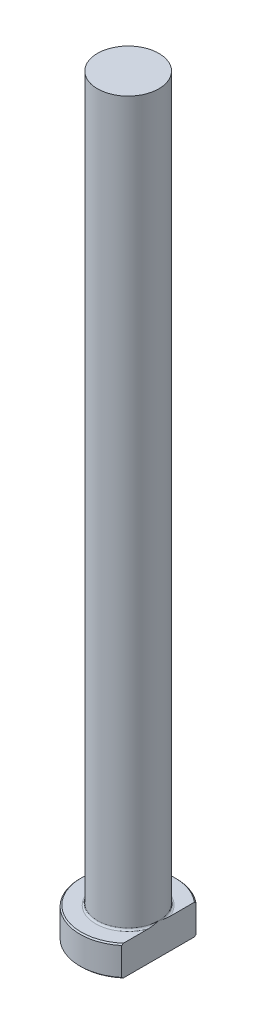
ISO-10303-21;
HEADER;
FILE_DESCRIPTION(('STEP AP214'),'2;1');
FILE_NAME('part.step','',(''),(''),'','','');
FILE_SCHEMA(('AUTOMOTIVE_DESIGN { 1 0 10303 214 1 1 1 1 }'));
ENDSEC;
DATA;
#1=APPLICATION_CONTEXT('core data for automotive mechanical design processes');
#2=APPLICATION_PROTOCOL_DEFINITION('international standard','automotive_design',2000,#1);
#3=PRODUCT_CONTEXT('',#1,'mechanical');
#4=PRODUCT('Part','Part','',(#3));
#5=PRODUCT_RELATED_PRODUCT_CATEGORY('part','',(#4));
#6=PRODUCT_DEFINITION_FORMATION('','',#4);
#7=PRODUCT_DEFINITION_CONTEXT('part definition',#1,'design');
#8=PRODUCT_DEFINITION('design','',#6,#7);
#9=PRODUCT_DEFINITION_SHAPE('','',#8);
#10=(LENGTH_UNIT() NAMED_UNIT(*) SI_UNIT(.MILLI.,.METRE.));
#11=(NAMED_UNIT(*) PLANE_ANGLE_UNIT() SI_UNIT($,.RADIAN.));
#12=(NAMED_UNIT(*) SI_UNIT($,.STERADIAN.) SOLID_ANGLE_UNIT());
#13=UNCERTAINTY_MEASURE_WITH_UNIT(LENGTH_MEASURE(1.E-05),#10,'distance_accuracy_value','');
#14=(GEOMETRIC_REPRESENTATION_CONTEXT(3) GLOBAL_UNCERTAINTY_ASSIGNED_CONTEXT((#13)) GLOBAL_UNIT_ASSIGNED_CONTEXT((#10,
#11,#12)) REPRESENTATION_CONTEXT('',''));
#15=CARTESIAN_POINT('',(0.,0.,0.));
#16=DIRECTION('',(0.,0.,1.));
#17=DIRECTION('',(1.,0.,0.));
#18=AXIS2_PLACEMENT_3D('',#15,#16,#17);
#19=CARTESIAN_POINT('',(0.,0.,0.));
#20=DIRECTION('',(0.,-1.,0.));
#21=DIRECTION('',(0.,0.,-1.));
#22=AXIS2_PLACEMENT_3D('',#19,#20,#21);
#23=PLANE('',#22);
#24=CARTESIAN_POINT('',(0.,0.,0.));
#25=DIRECTION('',(0.,-1.,0.));
#26=DIRECTION('',(0.,0.,-1.));
#27=AXIS2_PLACEMENT_3D('',#24,#25,#26);
#28=CIRCLE('',#27,7.80000000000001);
#29=CARTESIAN_POINT('',(5.09999999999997,0.,5.90169467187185));
#30=VERTEX_POINT('',#29);
#31=CARTESIAN_POINT('',(5.09999999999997,0.,-5.90169467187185));
#32=VERTEX_POINT('',#31);
#33=EDGE_CURVE('E98',#30,#32,#28,.T.);
#34=ORIENTED_EDGE('',*,*,#33,.T.);
#35=DIRECTION('',(0.,0.,1.));
#36=VECTOR('',#35,1.);
#37=CARTESIAN_POINT('',(5.09999999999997,0.,-6.16360284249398));
#38=LINE('',#37,#36);
#39=EDGE_CURVE('E83',#32,#30,#38,.T.);
#40=ORIENTED_EDGE('',*,*,#39,.T.);
#41=EDGE_LOOP('',(#34,#40));
#42=FACE_BOUND('',#41,.T.);
#43=ADVANCED_FACE('F32',(#42),#23,.T.);
#44=CARTESIAN_POINT('',(0.,259.958771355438,0.));
#45=DIRECTION('',(0.,1.,0.));
#46=DIRECTION('',(0.,0.,1.));
#47=AXIS2_PLACEMENT_3D('',#44,#45,#46);
#48=CYLINDRICAL_SURFACE('',#47,7.99999999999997);
#49=CARTESIAN_POINT('',(0.,4.79999999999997,0.));
#50=DIRECTION('',(0.,1.,0.));
#51=DIRECTION('',(0.,0.,1.));
#52=AXIS2_PLACEMENT_3D('',#49,#50,#51);
#53=CIRCLE('',#52,7.99999999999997);
#54=CARTESIAN_POINT('',(5.09999999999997,4.79999999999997,6.16360284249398));
#55=VERTEX_POINT('',#54);
#56=CARTESIAN_POINT('',(5.09999999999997,4.79999999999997,-6.16360284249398));
#57=VERTEX_POINT('',#56);
#58=EDGE_CURVE('E104',#55,#57,#53,.F.);
#59=ORIENTED_EDGE('',*,*,#58,.T.);
#60=DIRECTION('',(0.,-1.,0.));
#61=VECTOR('',#60,1.);
#62=CARTESIAN_POINT('',(5.09999999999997,125.,-6.16360284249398));
#63=LINE('',#62,#61);
#64=CARTESIAN_POINT('',(5.09999999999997,0.199999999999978,-6.16360284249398));
#65=VERTEX_POINT('',#64);
#66=EDGE_CURVE('E183',#57,#65,#63,.T.);
#67=ORIENTED_EDGE('',*,*,#66,.T.);
#68=CARTESIAN_POINT('',(0.,0.199999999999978,0.));
#69=DIRECTION('',(0.,-1.,0.));
#70=DIRECTION('',(0.,0.,-1.));
#71=AXIS2_PLACEMENT_3D('',#68,#69,#70);
#72=CIRCLE('',#71,7.99999999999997);
#73=CARTESIAN_POINT('',(5.09999999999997,0.199999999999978,6.16360284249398));
#74=VERTEX_POINT('',#73);
#75=EDGE_CURVE('E100',#65,#74,#72,.F.);
#76=ORIENTED_EDGE('',*,*,#75,.T.);
#77=DIRECTION('',(0.,-1.,0.));
#78=VECTOR('',#77,1.);
#79=CARTESIAN_POINT('',(5.09999999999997,125.,6.16360284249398));
#80=LINE('',#79,#78);
#81=EDGE_CURVE('E93',#55,#74,#80,.T.);
#82=ORIENTED_EDGE('',*,*,#81,.F.);
#83=EDGE_LOOP('',(#59,#67,#76,#82));
#84=FACE_BOUND('',#83,.T.);
#85=ADVANCED_FACE('F158',(#84),#48,.T.);
#86=CARTESIAN_POINT('',(-7.99999999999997,5.,0.));
#87=DIRECTION('',(0.,1.,0.));
#88=DIRECTION('',(0.,0.,1.));
#89=AXIS2_PLACEMENT_3D('',#86,#87,#88);
#90=PLANE('',#89);
#91=CARTESIAN_POINT('',(0.,5.,0.));
#92=DIRECTION('',(0.,1.,0.));
#93=DIRECTION('',(0.,0.,1.));
#94=AXIS2_PLACEMENT_3D('',#91,#92,#93);
#95=CIRCLE('',#94,7.79999999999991);
#96=CARTESIAN_POINT('',(5.09999999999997,5.,-5.90169467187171));
#97=VERTEX_POINT('',#96);
#98=CARTESIAN_POINT('',(5.09999999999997,5.,5.90169467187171));
#99=VERTEX_POINT('',#98);
#100=EDGE_CURVE('E178',#97,#99,#95,.T.);
#101=ORIENTED_EDGE('',*,*,#100,.T.);
#102=DIRECTION('',(0.,0.,-1.));
#103=VECTOR('',#102,1.);
#104=CARTESIAN_POINT('',(5.09999999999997,5.,0.));
#105=LINE('',#104,#103);
#106=CARTESIAN_POINT('',(5.09999999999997,4.99999999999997,1.77482393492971));
#107=VERTEX_POINT('',#106);
#108=EDGE_CURVE('E57',#99,#107,#105,.T.);
#109=ORIENTED_EDGE('',*,*,#108,.T.);
#110=CARTESIAN_POINT('',(0.,5.,0.));
#111=DIRECTION('',(0.,1.,0.));
#112=DIRECTION('',(0.,0.,1.));
#113=AXIS2_PLACEMENT_3D('',#110,#111,#112);
#114=CIRCLE('',#113,5.39999999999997);
#115=CARTESIAN_POINT('',(5.09999999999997,4.99999999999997,-1.77482393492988));
#116=VERTEX_POINT('',#115);
#117=EDGE_CURVE('E107',#107,#116,#114,.F.);
#118=ORIENTED_EDGE('',*,*,#117,.T.);
#119=EDGE_CURVE('E136',#116,#97,#105,.T.);
#120=ORIENTED_EDGE('',*,*,#119,.T.);
#121=EDGE_LOOP('',(#101,#109,#118,#120));
#122=FACE_BOUND('',#121,.T.);
#123=ADVANCED_FACE('F147',(#122),#90,.T.);
#124=CARTESIAN_POINT('',(0.,5.,0.));
#125=DIRECTION('',(0.,-1.,0.));
#126=DIRECTION('',(0.,0.,-1.));
#127=AXIS2_PLACEMENT_3D('',#124,#125,#126);
#128=CONICAL_SURFACE('',#127,7.7999999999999,0.785398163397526);
#129=ORIENTED_EDGE('',*,*,#58,.F.);
#130=CARTESIAN_POINT('',(5.09999999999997,-1.68838926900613,13.5610996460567));
#131=CARTESIAN_POINT('',(5.09999999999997,-1.4911744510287,13.3503958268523));
#132=CARTESIAN_POINT('',(5.09999999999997,-1.29425912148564,13.1394117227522));
#133=CARTESIAN_POINT('',(5.09999999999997,-0.90112453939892,12.716793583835));
#134=CARTESIAN_POINT('',(5.09999999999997,-0.704905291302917,12.5051595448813));
#135=CARTESIAN_POINT('',(5.09999999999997,-0.117342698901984,11.8690459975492));
#136=CARTESIAN_POINT('',(5.09999999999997,0.272806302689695,11.4434608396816));
#137=CARTESIAN_POINT('',(5.09999999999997,1.05193640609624,10.5848872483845));
#138=CARTESIAN_POINT('',(5.09999999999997,1.44088225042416,10.1518667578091));
#139=CARTESIAN_POINT('',(5.09999999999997,2.21252525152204,9.28039822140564));
#140=CARTESIAN_POINT('',(5.09999999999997,2.5952233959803,8.84195105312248));
#141=CARTESIAN_POINT('',(5.09999999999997,3.28346545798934,8.03678680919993));
#142=CARTESIAN_POINT('',(5.09999999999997,3.59050446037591,7.67135442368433));
#143=CARTESIAN_POINT('',(5.09999999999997,4.04444149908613,7.11764573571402));
#144=CARTESIAN_POINT('',(5.09999999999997,4.19468098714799,6.93211011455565));
#145=CARTESIAN_POINT('',(5.09999999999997,4.49242146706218,6.55885365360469));
#146=CARTESIAN_POINT('',(5.09999999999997,4.63992249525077,6.37113284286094));
#147=CARTESIAN_POINT('',(5.09999999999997,4.93124846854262,5.99346825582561));
#148=CARTESIAN_POINT('',(5.09999999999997,5.07508033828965,5.80352983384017));
#149=CARTESIAN_POINT('',(5.09999999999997,5.35853965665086,5.42051054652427));
#150=CARTESIAN_POINT('',(5.09999999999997,5.49816682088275,5.22742946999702));
#151=CARTESIAN_POINT('',(5.09999999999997,5.77196390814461,4.83761664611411));
#152=CARTESIAN_POINT('',(5.09999999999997,5.9061374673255,4.64088746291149));
#153=CARTESIAN_POINT('',(5.09999999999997,6.16753864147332,4.24288639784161));
#154=CARTESIAN_POINT('',(5.09999999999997,6.2947675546,4.04161537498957));
#155=CARTESIAN_POINT('',(5.09999999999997,6.51869473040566,3.66918005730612));
#156=CARTESIAN_POINT('',(5.09999999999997,6.61684568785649,3.49889306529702));
#157=CARTESIAN_POINT('',(5.09999999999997,6.80528626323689,3.15396122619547));
#158=CARTESIAN_POINT('',(5.09999999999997,6.8955749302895,2.97931585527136));
#159=CARTESIAN_POINT('',(5.09999999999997,7.06604933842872,2.6253063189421));
#160=CARTESIAN_POINT('',(5.09999999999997,7.14624387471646,2.44594642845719));
#161=CARTESIAN_POINT('',(5.09999999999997,7.29389284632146,2.08202755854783));
#162=CARTESIAN_POINT('',(5.09999999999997,7.36135077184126,1.89747001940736));
#163=CARTESIAN_POINT('',(5.09999999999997,7.4678794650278,1.56242413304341));
#164=CARTESIAN_POINT('',(5.09999999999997,7.50993657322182,1.41289089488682));
#165=CARTESIAN_POINT('',(5.09999999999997,7.58244227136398,1.11101527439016));
#166=CARTESIAN_POINT('',(5.09999999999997,7.61289239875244,0.95867326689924));
#167=CARTESIAN_POINT('',(5.09999999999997,7.66066060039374,0.652384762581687));
#168=CARTESIAN_POINT('',(5.09999999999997,7.67801796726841,0.498444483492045));
#169=CARTESIAN_POINT('',(5.09999999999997,7.69880109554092,0.189616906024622));
#170=CARTESIAN_POINT('',(5.09999999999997,7.70222744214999,0.0347296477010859));
#171=CARTESIAN_POINT('',(5.09999999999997,7.69494415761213,-0.274953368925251));
#172=CARTESIAN_POINT('',(5.09999999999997,7.68421202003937,-0.429748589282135));
#173=CARTESIAN_POINT('',(5.09999999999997,7.64918519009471,-0.737784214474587));
#174=CARTESIAN_POINT('',(5.09999999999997,7.62488939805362,-0.891024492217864));
#175=CARTESIAN_POINT('',(5.09999999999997,7.56389278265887,-1.19546940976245));
#176=CARTESIAN_POINT('',(5.09999999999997,7.52715417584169,-1.34666637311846));
#177=CARTESIAN_POINT('',(5.09999999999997,7.44288917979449,-1.64598767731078));
#178=CARTESIAN_POINT('',(5.09999999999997,7.39536249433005,-1.79411193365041));
#179=CARTESIAN_POINT('',(5.09999999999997,7.28286361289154,-2.11045286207));
#180=CARTESIAN_POINT('',(5.09999999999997,7.21631794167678,-2.27810587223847));
#181=CARTESIAN_POINT('',(5.09999999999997,7.07327742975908,-2.60914825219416));
#182=CARTESIAN_POINT('',(5.09999999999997,6.99677812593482,-2.77253566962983));
#183=CARTESIAN_POINT('',(5.09999999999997,6.83568399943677,-3.09559415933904));
#184=CARTESIAN_POINT('',(5.09999999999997,6.75107532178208,-3.25525827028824));
#185=CARTESIAN_POINT('',(5.09999999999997,6.57547395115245,-3.57098467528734));
#186=CARTESIAN_POINT('',(5.09999999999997,6.48448213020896,-3.72704745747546));
#187=CARTESIAN_POINT('',(5.09999999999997,6.29613682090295,-4.03803676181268));
#188=CARTESIAN_POINT('',(5.09999999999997,6.19871627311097,-4.19292248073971));
#189=CARTESIAN_POINT('',(5.09999999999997,5.99959202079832,-4.49991023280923));
#190=CARTESIAN_POINT('',(5.09999999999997,5.8978882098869,-4.65201219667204));
#191=CARTESIAN_POINT('',(5.09999999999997,5.69108681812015,-4.95365388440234));
#192=CARTESIAN_POINT('',(5.09999999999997,5.58599284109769,-5.1031960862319));
#193=CARTESIAN_POINT('',(5.09999999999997,5.37292107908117,-5.40020343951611));
#194=CARTESIAN_POINT('',(5.09999999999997,5.26494333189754,-5.5476686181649));
#195=CARTESIAN_POINT('',(5.09999999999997,5.0217883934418,-5.87409503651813));
#196=CARTESIAN_POINT('',(5.09999999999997,4.88600343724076,-6.05260304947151));
#197=CARTESIAN_POINT('',(5.09999999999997,4.61149829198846,-6.40735082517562));
#198=CARTESIAN_POINT('',(5.09999999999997,4.47277800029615,-6.58359050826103));
#199=CARTESIAN_POINT('',(5.09999999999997,4.05300130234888,-7.10948762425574));
#200=CARTESIAN_POINT('',(5.09999999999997,3.76835961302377,-7.45628264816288));
#201=CARTESIAN_POINT('',(5.09999999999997,3.192185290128,-8.14465597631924));
#202=CARTESIAN_POINT('',(5.09999999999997,2.90064601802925,-8.48622868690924));
#203=CARTESIAN_POINT('',(5.09999999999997,2.31275375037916,-9.16521513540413));
#204=CARTESIAN_POINT('',(5.09999999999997,2.01640062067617,-9.50262875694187));
#205=CARTESIAN_POINT('',(5.09999999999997,1.43877149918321,-10.1532482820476));
#206=CARTESIAN_POINT('',(5.09999999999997,1.15771277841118,-10.4666475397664));
#207=CARTESIAN_POINT('',(5.09999999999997,0.593133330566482,-11.091231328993));
#208=CARTESIAN_POINT('',(5.09999999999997,0.309612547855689,-11.4024158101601));
#209=CARTESIAN_POINT('',(5.09999999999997,-0.258772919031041,-12.0223487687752));
#210=CARTESIAN_POINT('',(5.09999999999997,-0.543633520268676,-12.3311009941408));
#211=CARTESIAN_POINT('',(5.09999999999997,-1.11492174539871,-12.9471274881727));
#212=CARTESIAN_POINT('',(5.09999999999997,-1.40134929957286,-13.2544018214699));
#213=CARTESIAN_POINT('',(5.09999999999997,-1.68838926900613,-13.5610996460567));
#214=B_SPLINE_CURVE_WITH_KNOTS('',3,(#130,#131,#132,#133,#134,#135,#136,#137,#138,#139,#140,
#141,#142,#143,#144,#145,#146,#147,#148,#149,#150,#151,#152,#153,#154,#155,#156,#157,#158,#159,
#160,#161,#162,#163,#164,#165,#166,#167,#168,#169,#170,#171,#172,#173,#174,#175,#176,#177,#178,
#179,#180,#181,#182,#183,#184,#185,#186,#187,#188,#189,#190,#191,#192,#193,#194,#195,#196,#197,
#198,#199,#200,#201,#202,#203,#204,#205,#206,#207,#208,#209,#210,#211,#212,#213),.UNSPECIFIED.,
.F.,.F.,(4,2,2,2,2,2,2,2,2,2,2,2,2,2,2,2,2,2,2,2,2,2,2,2,2,2,2,2,2,2,2,2,2,2,2,2,2,2,2,2,2,4),
(0.,0.865798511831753,1.73160254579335,3.4636456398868,5.20976443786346,6.95560446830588,
8.38738766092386,9.10357880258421,9.81976043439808,10.534471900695,11.2492315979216,
11.963506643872,12.6776477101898,13.267132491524,13.8566884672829,14.4457271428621,
15.0346041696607,15.500215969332,15.9657660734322,16.4299133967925,16.8940412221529,
17.3589077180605,17.8238119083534,18.2901406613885,18.7564822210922,19.2972067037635,
19.8381744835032,20.380083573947,20.9219187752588,21.4707620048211,22.0196188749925,
22.5679103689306,23.1161946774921,23.7890028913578,24.4618346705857,25.8076502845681,
27.1548185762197,28.5020244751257,29.7649097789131,31.0278236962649,32.288080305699,
33.5482812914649),.UNSPECIFIED.);
#215=EDGE_CURVE('E135',#55,#99,#214,.T.);
#216=ORIENTED_EDGE('',*,*,#215,.T.);
#217=ORIENTED_EDGE('',*,*,#100,.F.);
#218=EDGE_CURVE('E127',#97,#57,#214,.T.);
#219=ORIENTED_EDGE('',*,*,#218,.T.);
#220=EDGE_LOOP('',(#129,#216,#217,#219));
#221=FACE_BOUND('',#220,.T.);
#222=ADVANCED_FACE('F143',(#221),#128,.T.);
#223=CARTESIAN_POINT('',(0.,0.199999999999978,0.));
#224=DIRECTION('',(0.,1.,0.));
#225=DIRECTION('',(0.,0.,1.));
#226=AXIS2_PLACEMENT_3D('',#223,#224,#225);
#227=CONICAL_SURFACE('',#226,7.99999999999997,0.785398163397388);
#228=ORIENTED_EDGE('',*,*,#75,.F.);
#229=CARTESIAN_POINT('',(5.09999999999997,6.68838926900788,-13.5610996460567));
#230=CARTESIAN_POINT('',(5.09999999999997,6.49117445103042,-13.3503958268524));
#231=CARTESIAN_POINT('',(5.09999999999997,6.29425912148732,-13.1394117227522));
#232=CARTESIAN_POINT('',(5.09999999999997,5.90112453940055,-12.7167935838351));
#233=CARTESIAN_POINT('',(5.09999999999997,5.70490529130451,-12.5051595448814));
#234=CARTESIAN_POINT('',(5.09999999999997,5.11734269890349,-11.8690459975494));
#235=CARTESIAN_POINT('',(5.09999999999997,4.72719369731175,-11.4434608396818));
#236=CARTESIAN_POINT('',(5.09999999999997,3.94806359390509,-10.5848872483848));
#237=CARTESIAN_POINT('',(5.09999999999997,3.55911774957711,-10.1518667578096));
#238=CARTESIAN_POINT('',(5.09999999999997,2.78747474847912,-9.28039822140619));
#239=CARTESIAN_POINT('',(5.09999999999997,2.40477660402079,-8.84195105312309));
#240=CARTESIAN_POINT('',(5.09999999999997,1.7165345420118,-8.03678680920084));
#241=CARTESIAN_POINT('',(5.09999999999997,1.40949553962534,-7.67135442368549));
#242=CARTESIAN_POINT('',(5.09999999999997,0.955558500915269,-7.11764573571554));
#243=CARTESIAN_POINT('',(5.09999999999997,0.805319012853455,-6.9321101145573));
#244=CARTESIAN_POINT('',(5.09999999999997,0.507578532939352,-6.55885365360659));
#245=CARTESIAN_POINT('',(5.09999999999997,0.360077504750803,-6.37113284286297));
#246=CARTESIAN_POINT('',(5.09999999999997,0.0687515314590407,-5.99346825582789));
#247=CARTESIAN_POINT('',(5.09999999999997,-0.075080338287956,-5.80352983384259));
#248=CARTESIAN_POINT('',(5.09999999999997,-0.358539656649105,-5.42051054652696));
#249=CARTESIAN_POINT('',(5.09999999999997,-0.498166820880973,-5.22742946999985));
#250=CARTESIAN_POINT('',(5.09999999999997,-0.771963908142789,-4.83761664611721));
#251=CARTESIAN_POINT('',(5.09999999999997,-0.90613746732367,-4.64088746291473));
#252=CARTESIAN_POINT('',(5.09999999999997,-1.16753864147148,-4.24288639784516));
#253=CARTESIAN_POINT('',(5.09999999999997,-1.29476755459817,-4.04161537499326));
#254=CARTESIAN_POINT('',(5.09999999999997,-1.51869473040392,-3.66918005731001));
#255=CARTESIAN_POINT('',(5.09999999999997,-1.61684568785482,-3.49889306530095));
#256=CARTESIAN_POINT('',(5.09999999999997,-1.80528626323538,-3.15396122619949));
#257=CARTESIAN_POINT('',(5.09999999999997,-1.89557493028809,-2.97931585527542));
#258=CARTESIAN_POINT('',(5.09999999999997,-2.0660493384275,-2.62530631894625));
#259=CARTESIAN_POINT('',(5.09999999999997,-2.14624387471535,-2.44594642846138));
#260=CARTESIAN_POINT('',(5.09999999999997,-2.29389284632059,-2.08202755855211));
#261=CARTESIAN_POINT('',(5.09999999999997,-2.36135077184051,-1.89747001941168));
#262=CARTESIAN_POINT('',(5.09999999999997,-2.46787946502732,-1.56242413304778));
#263=CARTESIAN_POINT('',(5.09999999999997,-2.50993657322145,-1.41289089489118));
#264=CARTESIAN_POINT('',(5.09999999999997,-2.58244227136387,-1.11101527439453));
#265=CARTESIAN_POINT('',(5.09999999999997,-2.61289239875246,-0.958673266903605));
#266=CARTESIAN_POINT('',(5.09999999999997,-2.66066060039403,-0.652384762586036));
#267=CARTESIAN_POINT('',(5.09999999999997,-2.67801796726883,-0.498444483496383));
#268=CARTESIAN_POINT('',(5.09999999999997,-2.69880109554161,-0.189616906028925));
#269=CARTESIAN_POINT('',(5.09999999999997,-2.70222744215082,-0.0347296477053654));
#270=CARTESIAN_POINT('',(5.09999999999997,-2.69494415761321,0.274953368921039));
#271=CARTESIAN_POINT('',(5.09999999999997,-2.68421202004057,0.429748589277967));
#272=CARTESIAN_POINT('',(5.09999999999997,-2.64918519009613,0.737784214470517));
#273=CARTESIAN_POINT('',(5.09999999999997,-2.62488939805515,0.891024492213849));
#274=CARTESIAN_POINT('',(5.09999999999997,-2.56389278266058,1.19546940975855));
#275=CARTESIAN_POINT('',(5.09999999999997,-2.52715417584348,1.34666637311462));
#276=CARTESIAN_POINT('',(5.09999999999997,-2.44288917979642,1.64598767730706));
#277=CARTESIAN_POINT('',(5.09999999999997,-2.39536249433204,1.79411193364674));
#278=CARTESIAN_POINT('',(5.09999999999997,-2.2828636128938,2.11045286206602));
#279=CARTESIAN_POINT('',(5.09999999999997,-2.21631794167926,2.27810587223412));
#280=CARTESIAN_POINT('',(5.09999999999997,-2.07327742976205,2.60914825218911));
#281=CARTESIAN_POINT('',(5.09999999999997,-1.99677812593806,2.77253566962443));
#282=CARTESIAN_POINT('',(5.09999999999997,-1.83568399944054,3.09559415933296));
#283=CARTESIAN_POINT('',(5.09999999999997,-1.75107532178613,3.25525827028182));
#284=CARTESIAN_POINT('',(5.09999999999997,-1.57547395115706,3.57098467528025));
#285=CARTESIAN_POINT('',(5.09999999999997,-1.48448213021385,3.72704745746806));
#286=CARTESIAN_POINT('',(5.09999999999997,-1.29613682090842,4.03803676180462));
#287=CARTESIAN_POINT('',(5.09999999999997,-1.19871627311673,4.19292248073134));
#288=CARTESIAN_POINT('',(5.09999999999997,-0.999592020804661,4.49991023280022));
#289=CARTESIAN_POINT('',(5.09999999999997,-0.897888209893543,4.65201219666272));
#290=CARTESIAN_POINT('',(5.09999999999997,-0.691086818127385,4.95365388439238));
#291=CARTESIAN_POINT('',(5.09999999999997,-0.585992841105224,5.10319608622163));
#292=CARTESIAN_POINT('',(5.09999999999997,-0.372921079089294,5.40020343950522));
#293=CARTESIAN_POINT('',(5.09999999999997,-0.264943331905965,5.5476686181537));
#294=CARTESIAN_POINT('',(5.09999999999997,-0.0217883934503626,5.87409503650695));
#295=CARTESIAN_POINT('',(5.09999999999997,0.113996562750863,6.05260304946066));
#296=CARTESIAN_POINT('',(5.09999999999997,0.388501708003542,6.4073508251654));
#297=CARTESIAN_POINT('',(5.09999999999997,0.527221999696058,6.58359050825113));
#298=CARTESIAN_POINT('',(5.09999999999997,0.946998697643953,7.10948762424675));
#299=CARTESIAN_POINT('',(5.09999999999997,1.23164038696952,7.45628264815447));
#300=CARTESIAN_POINT('',(5.09999999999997,1.80781470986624,8.14465597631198));
#301=CARTESIAN_POINT('',(5.09999999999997,2.09935398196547,8.48622868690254));
#302=CARTESIAN_POINT('',(5.09999999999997,2.68724624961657,9.16521513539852));
#303=CARTESIAN_POINT('',(5.09999999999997,2.98359937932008,9.5026287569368));
#304=CARTESIAN_POINT('',(5.09999999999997,3.56122850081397,10.1532482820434));
#305=CARTESIAN_POINT('',(5.09999999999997,3.8422872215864,10.4666475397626));
#306=CARTESIAN_POINT('',(5.09999999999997,4.40686666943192,11.09123132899));
#307=CARTESIAN_POINT('',(5.09999999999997,4.69038745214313,11.4024158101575));
#308=CARTESIAN_POINT('',(5.09999999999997,5.2587729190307,12.0223487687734));
#309=CARTESIAN_POINT('',(5.09999999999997,5.54363352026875,12.3311009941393));
#310=CARTESIAN_POINT('',(5.09999999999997,6.11492174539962,12.947127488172));
#311=CARTESIAN_POINT('',(5.09999999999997,6.40134929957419,13.2544018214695));
#312=CARTESIAN_POINT('',(5.09999999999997,6.68838926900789,13.5610996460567));
#313=B_SPLINE_CURVE_WITH_KNOTS('',3,(#229,#230,#231,#232,#233,#234,#235,#236,#237,#238,#239,
#240,#241,#242,#243,#244,#245,#246,#247,#248,#249,#250,#251,#252,#253,#254,#255,#256,#257,#258,
#259,#260,#261,#262,#263,#264,#265,#266,#267,#268,#269,#270,#271,#272,#273,#274,#275,#276,#277,
#278,#279,#280,#281,#282,#283,#284,#285,#286,#287,#288,#289,#290,#291,#292,#293,#294,#295,#296,
#297,#298,#299,#300,#301,#302,#303,#304,#305,#306,#307,#308,#309,#310,#311,#312),.UNSPECIFIED.,
.F.,.F.,(4,2,2,2,2,2,2,2,2,2,2,2,2,2,2,2,2,2,2,2,2,2,2,2,2,2,2,2,2,2,2,2,2,2,2,2,2,2,2,2,2,4),
(0.,0.86579851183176,1.73160254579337,3.46364563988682,5.20976443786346,6.95560446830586,
8.38738766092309,9.10357880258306,9.81976043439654,10.5344719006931,11.2492315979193,
11.9635066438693,12.6776477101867,13.2671324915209,13.8566884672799,14.4457271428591,
15.0346041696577,15.5002159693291,15.9657660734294,16.4299133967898,16.8940412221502,
17.3589077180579,17.8238119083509,18.2901406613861,18.7564822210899,19.29720670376,
19.8381744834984,20.380083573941,20.9219187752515,21.4707620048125,22.0196188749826,
22.5679103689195,23.1161946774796,23.7890028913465,24.4618346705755,25.8076502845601,
27.1548185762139,28.5020244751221,29.7649097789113,31.0278236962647,32.2880803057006,
33.5482812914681),.UNSPECIFIED.);
#314=EDGE_CURVE('E86',#65,#32,#313,.T.);
#315=ORIENTED_EDGE('',*,*,#314,.T.);
#316=ORIENTED_EDGE('',*,*,#33,.F.);
#317=EDGE_CURVE('E89',#30,#74,#313,.T.);
#318=ORIENTED_EDGE('',*,*,#317,.T.);
#319=EDGE_LOOP('',(#228,#315,#316,#318));
#320=FACE_BOUND('',#319,.T.);
#321=ADVANCED_FACE('F97',(#320),#227,.T.);
#322=CARTESIAN_POINT('',(0.,5.29999999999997,0.));
#323=DIRECTION('',(0.,1.,0.));
#324=DIRECTION('',(0.,0.,1.));
#325=AXIS2_PLACEMENT_3D('',#322,#323,#324);
#326=TOROIDAL_SURFACE('',#325,5.39999999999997,0.3);
#327=CARTESIAN_POINT('',(5.09999999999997,5.29999999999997,0.));
#328=CARTESIAN_POINT('',(5.09999999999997,5.30000062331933,1.00502455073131E-10));
#329=CARTESIAN_POINT('',(5.09999999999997,5.30000124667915,-2.56272245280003E-07));
#330=CARTESIAN_POINT('',(5.09999999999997,5.30000240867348,-9.58155656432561E-07));
#331=CARTESIAN_POINT('',(5.09999999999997,5.30000293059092,-1.42128215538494E-06));
#332=CARTESIAN_POINT('',(5.09999999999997,5.30000402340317,-2.53262703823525E-06));
#333=CARTESIAN_POINT('',(5.09999999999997,5.30000457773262,-3.19888437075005E-06));
#334=CARTESIAN_POINT('',(5.09999999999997,5.3000055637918,-4.57422758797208E-06));
#335=CARTESIAN_POINT('',(5.09999999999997,5.3000059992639,-5.28085592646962E-06));
#336=CARTESIAN_POINT('',(5.09999999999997,5.3000076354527,-8.04031793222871E-06));
#337=CARTESIAN_POINT('',(5.09999999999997,5.30000874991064,-1.01478584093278E-05));
#338=CARTESIAN_POINT('',(5.09999999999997,5.30001056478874,-1.43037796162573E-05));
#339=CARTESIAN_POINT('',(5.09999999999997,5.30001129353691,-1.63402753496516E-05));
#340=CARTESIAN_POINT('',(5.09999999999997,5.30001438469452,-2.50239477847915E-05));
#341=CARTESIAN_POINT('',(5.09999999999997,5.30001671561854,-3.16857680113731E-05));
#342=CARTESIAN_POINT('',(5.09999999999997,5.30002011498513,-4.42245824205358E-05));
#343=CARTESIAN_POINT('',(5.09999999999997,5.30002132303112,-5.00633656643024E-05));
#344=CARTESIAN_POINT('',(5.09999999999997,5.30003017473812,-9.36444945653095E-05));
#345=CARTESIAN_POINT('',(5.09999999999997,5.30003694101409,-0.000131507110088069));
#346=CARTESIAN_POINT('',(5.09999999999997,5.30006656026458,-0.000281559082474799));
#347=CARTESIAN_POINT('',(5.09999999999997,5.30009476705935,-0.000392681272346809));
#348=CARTESIAN_POINT('',(5.09999999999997,5.30020497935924,-0.000834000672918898));
#349=CARTESIAN_POINT('',(5.09999999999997,5.30028356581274,-0.00116477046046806));
#350=CARTESIAN_POINT('',(5.09999999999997,5.3005991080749,-0.0024833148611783));
#351=CARTESIAN_POINT('',(5.09999999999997,5.30084040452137,-0.00347033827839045));
#352=CARTESIAN_POINT('',(5.09999999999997,5.30184681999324,-0.00759777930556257));
#353=CARTESIAN_POINT('',(5.09999999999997,5.30260646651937,-0.0107391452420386));
#354=CARTESIAN_POINT('',(5.09999999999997,5.30990583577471,-0.0409103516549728));
#355=CARTESIAN_POINT('',(5.09999999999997,5.31647007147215,-0.0679360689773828));
#356=CARTESIAN_POINT('',(5.09999999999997,5.32929459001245,-0.120902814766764));
#357=CARTESIAN_POINT('',(5.09999999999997,5.33555642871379,-0.146843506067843));
#358=CARTESIAN_POINT('',(5.09999999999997,5.34884216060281,-0.202060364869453));
#359=CARTESIAN_POINT('',(5.09999999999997,5.35586083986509,-0.231337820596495));
#360=CARTESIAN_POINT('',(5.09999999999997,5.36989412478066,-0.290236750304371));
#361=CARTESIAN_POINT('',(5.09999999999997,5.37690782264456,-0.319858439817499));
#362=CARTESIAN_POINT('',(5.09999999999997,5.39370531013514,-0.391396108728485));
#363=CARTESIAN_POINT('',(5.09999999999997,5.40343385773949,-0.433325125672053));
#364=CARTESIAN_POINT('',(5.09999999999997,5.42233571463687,-0.51616106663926));
#365=CARTESIAN_POINT('',(5.09999999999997,5.43151688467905,-0.55706619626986));
#366=CARTESIAN_POINT('',(5.09999999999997,5.45452080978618,-0.661777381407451));
#367=CARTESIAN_POINT('',(5.09999999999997,5.46807892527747,-0.725642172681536));
#368=CARTESIAN_POINT('',(5.09999999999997,5.4940673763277,-0.854162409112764));
#369=CARTESIAN_POINT('',(5.09999999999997,5.5064872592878,-0.918819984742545));
#370=CARTESIAN_POINT('',(5.09999999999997,5.53078685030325,-1.05464624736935));
#371=CARTESIAN_POINT('',(5.09999999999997,5.5425007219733,-1.12584508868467));
#372=CARTESIAN_POINT('',(5.09999999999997,5.56331904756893,-1.2686184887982));
#373=CARTESIAN_POINT('',(5.09999999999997,5.57242395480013,-1.34019298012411));
#374=CARTESIAN_POINT('',(5.09999999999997,5.58708832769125,-1.48237032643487));
#375=CARTESIAN_POINT('',(5.09999999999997,5.59271078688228,-1.55296638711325));
#376=CARTESIAN_POINT('',(5.09999999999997,5.59964105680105,-1.69455989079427));
#377=CARTESIAN_POINT('',(5.09999999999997,5.60093824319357,-1.7655578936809));
#378=CARTESIAN_POINT('',(5.09999999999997,5.59769411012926,-1.90544222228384));
#379=CARTESIAN_POINT('',(5.09999999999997,5.59332114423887,-1.97433003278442));
#380=CARTESIAN_POINT('',(5.09999999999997,5.58075096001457,-2.07681569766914));
#381=CARTESIAN_POINT('',(5.09999999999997,5.57557260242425,-2.11078113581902));
#382=CARTESIAN_POINT('',(5.09999999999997,5.56270516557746,-2.17822373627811));
#383=CARTESIAN_POINT('',(5.09999999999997,5.55501865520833,-2.21170136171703));
#384=CARTESIAN_POINT('',(5.09999999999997,5.54146504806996,-2.25971093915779));
#385=CARTESIAN_POINT('',(5.09999999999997,5.53689562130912,-2.27460808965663));
#386=CARTESIAN_POINT('',(5.09999999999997,5.52697250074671,-2.30414012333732));
#387=CARTESIAN_POINT('',(5.09999999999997,5.52161846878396,-2.31877489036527));
#388=CARTESIAN_POINT('',(5.09999999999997,5.50422688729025,-2.36209889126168));
#389=CARTESIAN_POINT('',(5.09999999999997,5.49083502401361,-2.3903019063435));
#390=CARTESIAN_POINT('',(5.09999999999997,5.46786086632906,-2.42877296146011));
#391=CARTESIAN_POINT('',(5.09999999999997,5.4603260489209,-2.44026309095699));
#392=CARTESIAN_POINT('',(5.09999999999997,5.44403681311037,-2.46240090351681));
#393=CARTESIAN_POINT('',(5.09999999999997,5.43527992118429,-2.47304680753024));
#394=CARTESIAN_POINT('',(5.09999999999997,5.41620529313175,-2.49317992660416));
#395=CARTESIAN_POINT('',(5.09999999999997,5.40586565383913,-2.50264683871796));
#396=CARTESIAN_POINT('',(5.09999999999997,5.3835690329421,-2.5194267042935));
#397=CARTESIAN_POINT('',(5.09999999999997,5.37162091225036,-2.5267508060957));
#398=CARTESIAN_POINT('',(5.09999999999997,5.35166538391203,-2.53574339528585));
#399=CARTESIAN_POINT('',(5.09999999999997,5.34414545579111,-2.53849221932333));
#400=CARTESIAN_POINT('',(5.09999999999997,5.32875362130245,-2.54271562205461));
#401=CARTESIAN_POINT('',(5.09999999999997,5.32088204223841,-2.5441913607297));
#402=CARTESIAN_POINT('',(5.09999999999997,5.30496570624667,-2.54573009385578));
#403=CARTESIAN_POINT('',(5.09999999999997,5.29692036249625,-2.54578715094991));
#404=CARTESIAN_POINT('',(5.09999999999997,5.28094771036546,-2.54446730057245));
#405=CARTESIAN_POINT('',(5.09999999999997,5.27302044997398,-2.54308982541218));
#406=CARTESIAN_POINT('',(5.09999999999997,5.25787452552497,-2.53913219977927));
#407=CARTESIAN_POINT('',(5.09999999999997,5.25064005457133,-2.53661104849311));
#408=CARTESIAN_POINT('',(5.09999999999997,5.23660403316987,-2.53057544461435));
#409=CARTESIAN_POINT('',(5.09999999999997,5.22980263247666,-2.52706065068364));
#410=CARTESIAN_POINT('',(5.09999999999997,5.21241680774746,-2.51668428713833));
#411=CARTESIAN_POINT('',(5.09999999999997,5.20224553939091,-2.50913195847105));
#412=CARTESIAN_POINT('',(5.09999999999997,5.18317971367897,-2.49255314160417));
#413=CARTESIAN_POINT('',(5.09999999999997,5.17428964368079,-2.48352169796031));
#414=CARTESIAN_POINT('',(5.09999999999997,5.15120222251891,-2.45711400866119));
#415=CARTESIAN_POINT('',(5.09999999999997,5.13821905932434,-2.43868687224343));
#416=CARTESIAN_POINT('',(5.09999999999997,5.11496748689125,-2.40025423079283));
#417=CARTESIAN_POINT('',(5.09999999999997,5.10470258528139,-2.38024672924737));
#418=CARTESIAN_POINT('',(5.09999999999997,5.08559509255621,-2.33784185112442));
#419=CARTESIAN_POINT('',(5.09999999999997,5.07690690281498,-2.31537591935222));
#420=CARTESIAN_POINT('',(5.09999999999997,5.06139749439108,-2.26979738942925));
#421=CARTESIAN_POINT('',(5.09999999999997,5.05457848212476,-2.24668406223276));
#422=CARTESIAN_POINT('',(5.09999999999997,5.04239975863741,-2.1998307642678));
#423=CARTESIAN_POINT('',(5.09999999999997,5.03705561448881,-2.17608680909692));
#424=CARTESIAN_POINT('',(5.09999999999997,5.02766167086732,-2.12836719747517));
#425=CARTESIAN_POINT('',(5.09999999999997,5.02361095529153,-2.10439171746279));
#426=CARTESIAN_POINT('',(5.09999999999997,5.01439130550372,-2.04113234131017));
#427=CARTESIAN_POINT('',(5.09999999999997,5.01012481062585,-2.00171697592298));
#428=CARTESIAN_POINT('',(5.09999999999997,5.00388663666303,-1.92269917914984));
#429=CARTESIAN_POINT('',(5.09999999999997,5.00191621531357,-1.88309665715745));
#430=CARTESIAN_POINT('',(5.09999999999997,4.99879803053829,-1.76395655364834));
#431=CARTESIAN_POINT('',(5.09999999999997,5.00047462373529,-1.68434528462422));
#432=CARTESIAN_POINT('',(5.09999999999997,5.00888754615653,-1.52975473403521));
#433=CARTESIAN_POINT('',(5.09999999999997,5.01534627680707,-1.45475708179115));
#434=CARTESIAN_POINT('',(5.09999999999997,5.0317664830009,-1.30572790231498));
#435=CARTESIAN_POINT('',(5.09999999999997,5.04170115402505,-1.23169335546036));
#436=CARTESIAN_POINT('',(5.09999999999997,5.06541265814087,-1.07626149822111));
#437=CARTESIAN_POINT('',(5.09999999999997,5.07948398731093,-0.99491013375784));
#438=CARTESIAN_POINT('',(5.09999999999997,5.10254680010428,-0.872231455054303));
#439=CARTESIAN_POINT('',(5.09999999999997,5.11066831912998,-0.830736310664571));
#440=CARTESIAN_POINT('',(5.09999999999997,5.12745388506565,-0.747740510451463));
#441=CARTESIAN_POINT('',(5.09999999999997,5.13611932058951,-0.706240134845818));
#442=CARTESIAN_POINT('',(5.09999999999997,5.15735306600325,-0.607104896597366));
#443=CARTESIAN_POINT('',(5.09999999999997,5.17012138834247,-0.549513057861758));
#444=CARTESIAN_POINT('',(5.09999999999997,5.19610836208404,-0.435113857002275));
#445=CARTESIAN_POINT('',(5.09999999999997,5.20932032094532,-0.378304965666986));
#446=CARTESIAN_POINT('',(5.09999999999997,5.23456914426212,-0.271298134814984));
#447=CARTESIAN_POINT('',(5.09999999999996,5.24656654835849,-0.221090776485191));
#448=CARTESIAN_POINT('',(5.09999999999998,5.27126433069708,-0.118550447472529));
#449=CARTESIAN_POINT('',(5.10000000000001,5.28397269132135,-0.0662193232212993));
#450=CARTESIAN_POINT('',(5.09999999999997,5.29739466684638,-0.0107340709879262));
#451=CARTESIAN_POINT('',(5.09999999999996,5.29815561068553,-0.00758765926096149));
#452=CARTESIAN_POINT('',(5.09999999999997,5.29916232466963,-0.00345908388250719));
#453=CARTESIAN_POINT('',(5.09999999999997,5.29940265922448,-0.00247597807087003));
#454=CARTESIAN_POINT('',(5.09999999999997,5.29971703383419,-0.00116231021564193));
#455=CARTESIAN_POINT('',(5.09999999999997,5.29979539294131,-0.000832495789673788));
#456=CARTESIAN_POINT('',(5.09999999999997,5.29990533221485,-0.000392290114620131));
#457=CARTESIAN_POINT('',(5.09999999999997,5.29993350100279,-0.000281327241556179));
#458=CARTESIAN_POINT('',(5.09999999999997,5.29996308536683,-0.000131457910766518));
#459=CARTESIAN_POINT('',(5.09999999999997,5.29996984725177,-9.36171898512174E-05));
#460=CARTESIAN_POINT('',(5.09999999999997,5.29997868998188,-5.00584682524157E-05));
#461=CARTESIAN_POINT('',(5.09999999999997,5.2999798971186,-4.42208592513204E-05));
#462=CARTESIAN_POINT('',(5.09999999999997,5.29998329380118,-3.16844912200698E-05));
#463=CARTESIAN_POINT('',(5.09999999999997,5.29998562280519,-2.50238809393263E-05));
#464=CARTESIAN_POINT('',(5.09999999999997,5.29998871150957,-1.63414750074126E-05));
#465=CARTESIAN_POINT('',(5.09999999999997,5.29998943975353,-1.43050668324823E-05));
#466=CARTESIAN_POINT('',(5.09999999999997,5.29999125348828,-1.01492415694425E-05));
#467=CARTESIAN_POINT('',(5.09999999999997,5.29999236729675,-8.04169787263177E-06));
#468=CARTESIAN_POINT('',(5.09999999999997,5.29999400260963,-5.28214008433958E-06));
#469=CARTESIAN_POINT('',(5.09999999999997,5.2999944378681,-4.57545909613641E-06));
#470=CARTESIAN_POINT('',(5.09999999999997,5.29999542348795,-3.19997201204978E-06));
#471=CARTESIAN_POINT('',(5.09999999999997,5.29999597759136,-2.53362183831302E-06));
#472=CARTESIAN_POINT('',(5.09999999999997,5.2999970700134,-1.42206069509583E-06));
#473=CARTESIAN_POINT('',(5.09999999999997,5.29999759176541,-9.58819427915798E-07));
#474=CARTESIAN_POINT('',(5.09999999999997,5.29999875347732,-2.566431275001E-07));
#475=CARTESIAN_POINT('',(5.09999999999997,5.29999937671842,-1.00496358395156E-10));
#476=CARTESIAN_POINT('',(5.09999999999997,5.29999999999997,0.));
#477=B_SPLINE_CURVE_WITH_KNOTS('',3,(#327,#328,#329,#330,#331,#332,#333,#334,#335,#336,#337,
#338,#339,#340,#341,#342,#343,#344,#345,#346,#347,#348,#349,#350,#351,#352,#353,#354,#355,#356,
#357,#358,#359,#360,#361,#362,#363,#364,#365,#366,#367,#368,#369,#370,#371,#372,#373,#374,#375,
#376,#377,#378,#379,#380,#381,#382,#383,#384,#385,#386,#387,#388,#389,#390,#391,#392,#393,#394,
#395,#396,#397,#398,#399,#400,#401,#402,#403,#404,#405,#406,#407,#408,#409,#410,#411,#412,#413,
#414,#415,#416,#417,#418,#419,#420,#421,#422,#423,#424,#425,#426,#427,#428,#429,#430,#431,#432,
#433,#434,#435,#436,#437,#438,#439,#440,#441,#442,#443,#444,#445,#446,#447,#448,#449,#450,#451,
#452,#453,#454,#455,#456,#457,#458,#459,#460,#461,#462,#463,#464,#465,#466,#467,#468,#469,#470,
#471,#472,#473,#474,#475,#476),.UNSPECIFIED.,.T.,.F.,(4,2,2,2,2,2,2,2,2,2,2,2,2,2,2,2,2,2,2,2,2,
2,2,2,2,2,2,2,2,2,2,2,2,2,2,2,2,2,2,2,2,2,2,2,2,2,2,2,2,2,2,2,2,2,2,2,2,2,2,2,2,2,2,2,2,2,2,2,2,
2,2,2,2,2,4),(0.,1.89160361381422E-06,3.99004216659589E-06,6.57353785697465E-06,
9.06254729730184E-06,1.61899929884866E-05,2.26728988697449E-05,4.38126588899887E-05,
6.1678916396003E-05,0.000177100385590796,0.000520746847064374,0.00154098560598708,
0.00458888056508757,0.0142850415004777,0.0977171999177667,0.177775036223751,0.268095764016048,
0.359417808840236,0.48854538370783,0.614312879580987,0.810167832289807,1.00767122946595,
1.22410237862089,1.44049590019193,1.65285112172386,1.86572757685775,2.07242589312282,
2.17543511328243,2.27833915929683,2.32506388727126,2.37180881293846,2.46500788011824,
2.50617281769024,2.54742231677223,2.58930523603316,2.6309662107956,2.6548934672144,
2.67879889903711,2.70280436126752,2.72681932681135,2.7497158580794,2.7726202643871,
2.8104058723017,2.84832076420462,2.91556471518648,2.98289501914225,3.05504478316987,
3.12727935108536,3.20024948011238,3.27316781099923,3.39200983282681,3.51091692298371,
3.74950974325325,3.97524204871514,4.19927066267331,4.44689882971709,4.5737438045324,
4.70092693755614,4.87789308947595,5.05286589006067,5.20772921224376,5.36928080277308,
5.37899257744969,5.38202837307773,5.38304566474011,5.38338882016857,5.38350417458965,
5.38352203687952,5.38354317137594,5.3835496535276,5.38355678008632,5.38355926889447,
5.38356185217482,5.3835639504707,5.38356584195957),.UNSPECIFIED.);
#478=CARTESIAN_POINT('',(5.09999999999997,5.29999999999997,0.));
#479=VERTEX_POINT('',#478);
#480=EDGE_CURVE('E11',#116,#479,#477,.T.);
#481=ORIENTED_EDGE('',*,*,#480,.F.);
#482=ORIENTED_EDGE('',*,*,#117,.F.);
#483=CARTESIAN_POINT('',(5.09999999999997,5.29999999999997,0.));
#484=CARTESIAN_POINT('',(5.09999999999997,5.29999937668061,-1.00502438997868E-10));
#485=CARTESIAN_POINT('',(5.09999999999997,5.2999987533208,2.56272245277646E-07));
#486=CARTESIAN_POINT('',(5.09999999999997,5.29999759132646,9.58155656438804E-07));
#487=CARTESIAN_POINT('',(5.09999999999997,5.29999706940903,1.42128215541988E-06));
#488=CARTESIAN_POINT('',(5.09999999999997,5.29999597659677,2.53262703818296E-06));
#489=CARTESIAN_POINT('',(5.09999999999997,5.29999542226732,3.19888437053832E-06));
#490=CARTESIAN_POINT('',(5.09999999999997,5.29999443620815,4.57422758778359E-06));
#491=CARTESIAN_POINT('',(5.09999999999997,5.29999400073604,5.28085592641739E-06));
#492=CARTESIAN_POINT('',(5.09999999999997,5.29999236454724,8.0403179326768E-06));
#493=CARTESIAN_POINT('',(5.09999999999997,5.2999912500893,1.01478584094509E-05));
#494=CARTESIAN_POINT('',(5.09999999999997,5.2999894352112,1.43037796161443E-05));
#495=CARTESIAN_POINT('',(5.09999999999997,5.29998870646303,1.6340275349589E-05));
#496=CARTESIAN_POINT('',(5.09999999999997,5.29998561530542,2.50239477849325E-05));
#497=CARTESIAN_POINT('',(5.09999999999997,5.2999832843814,3.16857680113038E-05));
#498=CARTESIAN_POINT('',(5.09999999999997,5.29997988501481,4.42245824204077E-05));
#499=CARTESIAN_POINT('',(5.09999999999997,5.29997867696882,5.00633656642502E-05));
#500=CARTESIAN_POINT('',(5.09999999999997,5.29996982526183,9.36444945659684E-05));
#501=CARTESIAN_POINT('',(5.09999999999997,5.29996305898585,0.000131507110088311));
#502=CARTESIAN_POINT('',(5.09999999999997,5.29993343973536,0.000281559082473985));
#503=CARTESIAN_POINT('',(5.09999999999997,5.29990523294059,0.000392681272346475));
#504=CARTESIAN_POINT('',(5.09999999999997,5.29979502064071,0.000834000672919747));
#505=CARTESIAN_POINT('',(5.09999999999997,5.2997164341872,0.00116477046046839));
#506=CARTESIAN_POINT('',(5.09999999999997,5.29940089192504,0.00248331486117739));
#507=CARTESIAN_POINT('',(5.09999999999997,5.29915959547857,0.00347033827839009));
#508=CARTESIAN_POINT('',(5.09999999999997,5.2981531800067,0.00759777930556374));
#509=CARTESIAN_POINT('',(5.09999999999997,5.29739353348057,0.0107391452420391));
#510=CARTESIAN_POINT('',(5.09999999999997,5.29009416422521,0.0409103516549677));
#511=CARTESIAN_POINT('',(5.09999999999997,5.28352992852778,0.0679360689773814));
#512=CARTESIAN_POINT('',(5.09999999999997,5.2707054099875,0.120902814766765));
#513=CARTESIAN_POINT('',(5.09999999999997,5.26444357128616,0.146843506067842));
#514=CARTESIAN_POINT('',(5.09999999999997,5.25115783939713,0.202060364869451));
#515=CARTESIAN_POINT('',(5.09999999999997,5.24413916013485,0.231337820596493));
#516=CARTESIAN_POINT('',(5.09999999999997,5.23010587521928,0.29023675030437));
#517=CARTESIAN_POINT('',(5.09999999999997,5.22309217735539,0.319858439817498));
#518=CARTESIAN_POINT('',(5.09999999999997,5.20629468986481,0.391396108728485));
#519=CARTESIAN_POINT('',(5.09999999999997,5.19656614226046,0.433325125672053));
#520=CARTESIAN_POINT('',(5.09999999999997,5.17766428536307,0.51616106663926));
#521=CARTESIAN_POINT('',(5.09999999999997,5.16848311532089,0.55706619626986));
#522=CARTESIAN_POINT('',(5.09999999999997,5.14547919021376,0.661777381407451));
#523=CARTESIAN_POINT('',(5.09999999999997,5.13192107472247,0.725642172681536));
#524=CARTESIAN_POINT('',(5.09999999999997,5.10593262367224,0.854162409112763));
#525=CARTESIAN_POINT('',(5.09999999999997,5.09351274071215,0.918819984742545));
#526=CARTESIAN_POINT('',(5.09999999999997,5.06921314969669,1.05464624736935));
#527=CARTESIAN_POINT('',(5.09999999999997,5.05749927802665,1.12584508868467));
#528=CARTESIAN_POINT('',(5.09999999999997,5.03668095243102,1.2686184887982));
#529=CARTESIAN_POINT('',(5.09999999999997,5.02757604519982,1.34019298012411));
#530=CARTESIAN_POINT('',(5.09999999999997,5.0129116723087,1.48237032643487));
#531=CARTESIAN_POINT('',(5.09999999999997,5.00728921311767,1.55296638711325));
#532=CARTESIAN_POINT('',(5.09999999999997,5.00035894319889,1.69455989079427));
#533=CARTESIAN_POINT('',(5.09999999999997,4.99906175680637,1.7655578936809));
#534=CARTESIAN_POINT('',(5.09999999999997,5.00230588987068,1.90544222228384));
#535=CARTESIAN_POINT('',(5.09999999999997,5.00667885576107,1.97433003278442));
#536=CARTESIAN_POINT('',(5.09999999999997,5.01924903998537,2.07681569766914));
#537=CARTESIAN_POINT('',(5.09999999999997,5.02442739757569,2.11078113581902));
#538=CARTESIAN_POINT('',(5.09999999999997,5.03729483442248,2.17822373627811));
#539=CARTESIAN_POINT('',(5.09999999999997,5.04498134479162,2.21170136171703));
#540=CARTESIAN_POINT('',(5.09999999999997,5.05853495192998,2.25971093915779));
#541=CARTESIAN_POINT('',(5.09999999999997,5.06310437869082,2.27460808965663));
#542=CARTESIAN_POINT('',(5.09999999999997,5.07302749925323,2.30414012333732));
#543=CARTESIAN_POINT('',(5.09999999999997,5.07838153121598,2.31877489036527));
#544=CARTESIAN_POINT('',(5.09999999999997,5.09577311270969,2.36209889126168));
#545=CARTESIAN_POINT('',(5.09999999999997,5.10916497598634,2.3903019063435));
#546=CARTESIAN_POINT('',(5.09999999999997,5.13213913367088,2.42877296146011));
#547=CARTESIAN_POINT('',(5.09999999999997,5.13967395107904,2.44026309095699));
#548=CARTESIAN_POINT('',(5.09999999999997,5.15596318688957,2.46240090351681));
#549=CARTESIAN_POINT('',(5.09999999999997,5.16472007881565,2.47304680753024));
#550=CARTESIAN_POINT('',(5.09999999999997,5.18379470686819,2.49317992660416));
#551=CARTESIAN_POINT('',(5.09999999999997,5.19413434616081,2.50264683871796));
#552=CARTESIAN_POINT('',(5.09999999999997,5.21643096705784,2.5194267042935));
#553=CARTESIAN_POINT('',(5.09999999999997,5.22837908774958,2.5267508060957));
#554=CARTESIAN_POINT('',(5.09999999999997,5.24833461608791,2.53574339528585));
#555=CARTESIAN_POINT('',(5.09999999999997,5.25585454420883,2.53849221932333));
#556=CARTESIAN_POINT('',(5.09999999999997,5.2712463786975,2.54271562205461));
#557=CARTESIAN_POINT('',(5.09999999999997,5.27911795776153,2.5441913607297));
#558=CARTESIAN_POINT('',(5.09999999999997,5.29503429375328,2.54573009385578));
#559=CARTESIAN_POINT('',(5.09999999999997,5.3030796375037,2.54578715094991));
#560=CARTESIAN_POINT('',(5.09999999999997,5.31905228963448,2.54446730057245));
#561=CARTESIAN_POINT('',(5.09999999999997,5.32697955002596,2.54308982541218));
#562=CARTESIAN_POINT('',(5.09999999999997,5.34212547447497,2.53913219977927));
#563=CARTESIAN_POINT('',(5.09999999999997,5.34935994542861,2.53661104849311));
#564=CARTESIAN_POINT('',(5.09999999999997,5.36339596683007,2.53057544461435));
#565=CARTESIAN_POINT('',(5.09999999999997,5.37019736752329,2.52706065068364));
#566=CARTESIAN_POINT('',(5.09999999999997,5.38758319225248,2.51668428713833));
#567=CARTESIAN_POINT('',(5.09999999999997,5.39775446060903,2.50913195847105));
#568=CARTESIAN_POINT('',(5.09999999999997,5.41682028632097,2.49255314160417));
#569=CARTESIAN_POINT('',(5.09999999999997,5.42571035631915,2.48352169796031));
#570=CARTESIAN_POINT('',(5.09999999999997,5.44879777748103,2.45711400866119));
#571=CARTESIAN_POINT('',(5.09999999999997,5.4617809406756,2.43868687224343));
#572=CARTESIAN_POINT('',(5.09999999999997,5.48503251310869,2.40025423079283));
#573=CARTESIAN_POINT('',(5.09999999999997,5.49529741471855,2.38024672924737));
#574=CARTESIAN_POINT('',(5.09999999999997,5.51440490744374,2.33784185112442));
#575=CARTESIAN_POINT('',(5.09999999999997,5.52309309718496,2.31537591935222));
#576=CARTESIAN_POINT('',(5.09999999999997,5.53860250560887,2.26979738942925));
#577=CARTESIAN_POINT('',(5.09999999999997,5.54542151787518,2.24668406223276));
#578=CARTESIAN_POINT('',(5.09999999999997,5.55760024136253,2.1998307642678));
#579=CARTESIAN_POINT('',(5.09999999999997,5.56294438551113,2.17608680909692));
#580=CARTESIAN_POINT('',(5.09999999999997,5.57233832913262,2.12836719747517));
#581=CARTESIAN_POINT('',(5.09999999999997,5.57638904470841,2.10439171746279));
#582=CARTESIAN_POINT('',(5.09999999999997,5.58560869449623,2.04113234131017));
#583=CARTESIAN_POINT('',(5.09999999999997,5.5898751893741,2.00171697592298));
#584=CARTESIAN_POINT('',(5.09999999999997,5.59611336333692,1.92269917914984));
#585=CARTESIAN_POINT('',(5.09999999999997,5.59808378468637,1.88309665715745));
#586=CARTESIAN_POINT('',(5.09999999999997,5.60120196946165,1.76395655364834));
#587=CARTESIAN_POINT('',(5.09999999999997,5.59952537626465,1.68434528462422));
#588=CARTESIAN_POINT('',(5.09999999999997,5.59111245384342,1.5297547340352));
#589=CARTESIAN_POINT('',(5.09999999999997,5.58465372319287,1.45475708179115));
#590=CARTESIAN_POINT('',(5.09999999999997,5.56823351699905,1.30572790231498));
#591=CARTESIAN_POINT('',(5.09999999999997,5.55829884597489,1.23169335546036));
#592=CARTESIAN_POINT('',(5.09999999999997,5.53458734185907,1.07626149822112));
#593=CARTESIAN_POINT('',(5.09999999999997,5.52051601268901,0.994910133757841));
#594=CARTESIAN_POINT('',(5.09999999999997,5.49745319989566,0.872231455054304));
#595=CARTESIAN_POINT('',(5.09999999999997,5.48933168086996,0.830736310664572));
#596=CARTESIAN_POINT('',(5.09999999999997,5.47254611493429,0.747740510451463));
#597=CARTESIAN_POINT('',(5.09999999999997,5.46388067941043,0.706240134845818));
#598=CARTESIAN_POINT('',(5.09999999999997,5.44264693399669,0.607104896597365));
#599=CARTESIAN_POINT('',(5.09999999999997,5.42987861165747,0.549513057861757));
#600=CARTESIAN_POINT('',(5.09999999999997,5.4038916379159,0.435113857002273));
#601=CARTESIAN_POINT('',(5.09999999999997,5.39067967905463,0.378304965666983));
#602=CARTESIAN_POINT('',(5.09999999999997,5.36543085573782,0.271298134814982));
#603=CARTESIAN_POINT('',(5.09999999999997,5.35343345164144,0.22109077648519));
#604=CARTESIAN_POINT('',(5.09999999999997,5.32873566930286,0.118550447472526));
#605=CARTESIAN_POINT('',(5.09999999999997,5.31602730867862,0.0662193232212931));
#606=CARTESIAN_POINT('',(5.09999999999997,5.30260533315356,0.0107340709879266));
#607=CARTESIAN_POINT('',(5.09999999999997,5.3018443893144,0.00758765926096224));
#608=CARTESIAN_POINT('',(5.09999999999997,5.30083767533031,0.00345908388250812));
#609=CARTESIAN_POINT('',(5.09999999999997,5.30059734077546,0.00247597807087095));
#610=CARTESIAN_POINT('',(5.09999999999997,5.30028296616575,0.00116231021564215));
#611=CARTESIAN_POINT('',(5.09999999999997,5.30020460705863,0.00083249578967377));
#612=CARTESIAN_POINT('',(5.09999999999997,5.30009466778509,0.000392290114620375));
#613=CARTESIAN_POINT('',(5.09999999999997,5.30006649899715,0.00028132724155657));
#614=CARTESIAN_POINT('',(5.09999999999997,5.30003691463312,0.000131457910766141));
#615=CARTESIAN_POINT('',(5.09999999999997,5.30003015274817,9.36171898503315E-05));
#616=CARTESIAN_POINT('',(5.09999999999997,5.30002131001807,5.00584682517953E-05));
#617=CARTESIAN_POINT('',(5.09999999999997,5.30002010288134,4.42208592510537E-05));
#618=CARTESIAN_POINT('',(5.09999999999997,5.30001670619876,3.16844912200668E-05));
#619=CARTESIAN_POINT('',(5.09999999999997,5.30001437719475,2.50238809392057E-05));
#620=CARTESIAN_POINT('',(5.09999999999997,5.30001128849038,1.63414750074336E-05));
#621=CARTESIAN_POINT('',(5.09999999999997,5.30001056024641,1.4305066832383E-05));
#622=CARTESIAN_POINT('',(5.09999999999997,5.30000874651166,1.0149241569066E-05));
#623=CARTESIAN_POINT('',(5.09999999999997,5.3000076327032,8.04169787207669E-06));
#624=CARTESIAN_POINT('',(5.09999999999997,5.30000599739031,5.28214008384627E-06));
#625=CARTESIAN_POINT('',(5.09999999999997,5.30000556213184,4.57545909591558E-06));
#626=CARTESIAN_POINT('',(5.09999999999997,5.30000457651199,3.19997201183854E-06));
#627=CARTESIAN_POINT('',(5.09999999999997,5.30000402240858,2.53362183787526E-06));
#628=CARTESIAN_POINT('',(5.09999999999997,5.30000292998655,1.42206069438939E-06));
#629=CARTESIAN_POINT('',(5.09999999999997,5.30000240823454,9.58819427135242E-07));
#630=CARTESIAN_POINT('',(5.09999999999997,5.30000124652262,2.56643127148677E-07));
#631=CARTESIAN_POINT('',(5.09999999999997,5.30000062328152,1.00496342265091E-10));
#632=CARTESIAN_POINT('',(5.09999999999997,5.29999999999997,0.));
#633=B_SPLINE_CURVE_WITH_KNOTS('',3,(#483,#484,#485,#486,#487,#488,#489,#490,#491,#492,#493,
#494,#495,#496,#497,#498,#499,#500,#501,#502,#503,#504,#505,#506,#507,#508,#509,#510,#511,#512,
#513,#514,#515,#516,#517,#518,#519,#520,#521,#522,#523,#524,#525,#526,#527,#528,#529,#530,#531,
#532,#533,#534,#535,#536,#537,#538,#539,#540,#541,#542,#543,#544,#545,#546,#547,#548,#549,#550,
#551,#552,#553,#554,#555,#556,#557,#558,#559,#560,#561,#562,#563,#564,#565,#566,#567,#568,#569,
#570,#571,#572,#573,#574,#575,#576,#577,#578,#579,#580,#581,#582,#583,#584,#585,#586,#587,#588,
#589,#590,#591,#592,#593,#594,#595,#596,#597,#598,#599,#600,#601,#602,#603,#604,#605,#606,#607,
#608,#609,#610,#611,#612,#613,#614,#615,#616,#617,#618,#619,#620,#621,#622,#623,#624,#625,#626,
#627,#628,#629,#630,#631,#632),.UNSPECIFIED.,.T.,.F.,(4,2,2,2,2,2,2,2,2,2,2,2,2,2,2,2,2,2,2,2,2,
2,2,2,2,2,2,2,2,2,2,2,2,2,2,2,2,2,2,2,2,2,2,2,2,2,2,2,2,2,2,2,2,2,2,2,2,2,2,2,2,2,2,2,2,2,2,2,2,
2,2,2,2,2,4),(0.,1.89160361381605E-06,3.99004216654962E-06,6.5735378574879E-06,
9.06254729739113E-06,1.61899929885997E-05,2.26728988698E-05,4.38126588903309E-05,
6.16789163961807E-05,0.000177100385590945,0.000520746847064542,0.00154098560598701,
0.00458888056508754,0.0142850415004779,0.0977171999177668,0.177775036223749,0.268095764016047,
0.359417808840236,0.48854538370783,0.614312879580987,0.810167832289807,1.00767122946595,
1.22410237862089,1.44049590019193,1.65285112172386,1.86572757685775,2.07242589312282,
2.17543511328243,2.27833915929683,2.32506388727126,2.37180881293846,2.46500788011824,
2.50617281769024,2.54742231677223,2.58930523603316,2.6309662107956,2.65489346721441,
2.67879889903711,2.70280436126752,2.72681932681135,2.74971585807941,2.7726202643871,
2.8104058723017,2.84832076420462,2.91556471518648,2.98289501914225,3.05504478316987,
3.12727935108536,3.20024948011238,3.27316781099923,3.39200983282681,3.51091692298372,
3.74950974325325,3.97524204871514,4.19927066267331,4.44689882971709,4.5737438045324,
4.70092693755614,4.87789308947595,5.05286589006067,5.20772921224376,5.36928080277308,
5.37899257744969,5.38202837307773,5.38304566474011,5.38338882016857,5.38350417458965,
5.38352203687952,5.38354317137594,5.3835496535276,5.38355678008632,5.38355926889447,
5.38356185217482,5.3835639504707,5.38356584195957),.UNSPECIFIED.);
#634=EDGE_CURVE('E46',#479,#107,#633,.T.);
#635=ORIENTED_EDGE('',*,*,#634,.F.);
#636=CARTESIAN_POINT('',(0.,5.29999999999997,0.));
#637=DIRECTION('',(0.,1.,0.));
#638=DIRECTION('',(0.,0.,1.));
#639=AXIS2_PLACEMENT_3D('',#636,#637,#638);
#640=CIRCLE('',#639,5.09999999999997);
#641=EDGE_CURVE('E103',#479,#479,#640,.T.);
#642=ORIENTED_EDGE('',*,*,#641,.F.);
#643=EDGE_LOOP('',(#481,#482,#635,#642));
#644=FACE_BOUND('',#643,.T.);
#645=ADVANCED_FACE('F34',(#644),#326,.F.);
#646=CARTESIAN_POINT('',(0.,259.958771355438,0.));
#647=DIRECTION('',(0.,1.,0.));
#648=DIRECTION('',(0.,0.,1.));
#649=AXIS2_PLACEMENT_3D('',#646,#647,#648);
#650=CYLINDRICAL_SURFACE('',#649,5.09999999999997);
#651=ORIENTED_EDGE('',*,*,#641,.T.);
#652=EDGE_LOOP('',(#651));
#653=FACE_BOUND('',#652,.T.);
#654=CARTESIAN_POINT('',(0.,125.,0.));
#655=DIRECTION('',(0.,1.,0.));
#656=DIRECTION('',(0.,0.,1.));
#657=AXIS2_PLACEMENT_3D('',#654,#655,#656);
#658=CIRCLE('',#657,5.09999999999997);
#659=CARTESIAN_POINT('',(0.,125.,5.09999999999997));
#660=VERTEX_POINT('',#659);
#661=EDGE_CURVE('E101',#660,#660,#658,.T.);
#662=ORIENTED_EDGE('',*,*,#661,.F.);
#663=EDGE_LOOP('',(#662));
#664=FACE_BOUND('',#663,.T.);
#665=ADVANCED_FACE('F155',(#653,#664),#650,.T.);
#666=CARTESIAN_POINT('',(-5.09999999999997,125.,0.));
#667=DIRECTION('',(0.,1.,0.));
#668=DIRECTION('',(0.,0.,1.));
#669=AXIS2_PLACEMENT_3D('',#666,#667,#668);
#670=PLANE('',#669);
#671=ORIENTED_EDGE('',*,*,#661,.T.);
#672=EDGE_LOOP('',(#671));
#673=FACE_BOUND('',#672,.T.);
#674=ADVANCED_FACE('F121',(#673),#670,.T.);
#675=CARTESIAN_POINT('',(5.09999999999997,125.,-6.16360284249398));
#676=DIRECTION('',(1.,0.,0.));
#677=DIRECTION('',(0.,0.,-1.));
#678=AXIS2_PLACEMENT_3D('',#675,#676,#677);
#679=PLANE('',#678);
#680=ORIENTED_EDGE('',*,*,#66,.F.);
#681=ORIENTED_EDGE('',*,*,#218,.F.);
#682=ORIENTED_EDGE('',*,*,#119,.F.);
#683=ORIENTED_EDGE('',*,*,#480,.T.);
#684=ORIENTED_EDGE('',*,*,#634,.T.);
#685=ORIENTED_EDGE('',*,*,#108,.F.);
#686=ORIENTED_EDGE('',*,*,#215,.F.);
#687=ORIENTED_EDGE('',*,*,#81,.T.);
#688=ORIENTED_EDGE('',*,*,#317,.F.);
#689=ORIENTED_EDGE('',*,*,#39,.F.);
#690=ORIENTED_EDGE('',*,*,#314,.F.);
#691=EDGE_LOOP('',(#680,#681,#682,#683,#684,#685,#686,#687,#688,#689,#690));
#692=FACE_BOUND('',#691,.T.);
#693=ADVANCED_FACE('F85',(#692),#679,.T.);
#694=CLOSED_SHELL('',(#43,#85,#123,#222,#321,#645,#665,#674,#693));
#695=MANIFOLD_SOLID_BREP('B2',#694);
#696=ADVANCED_BREP_SHAPE_REPRESENTATION('',(#18,#695),#14);
#697=SHAPE_DEFINITION_REPRESENTATION(#9,#696);
ENDSEC;
END-ISO-10303-21;
